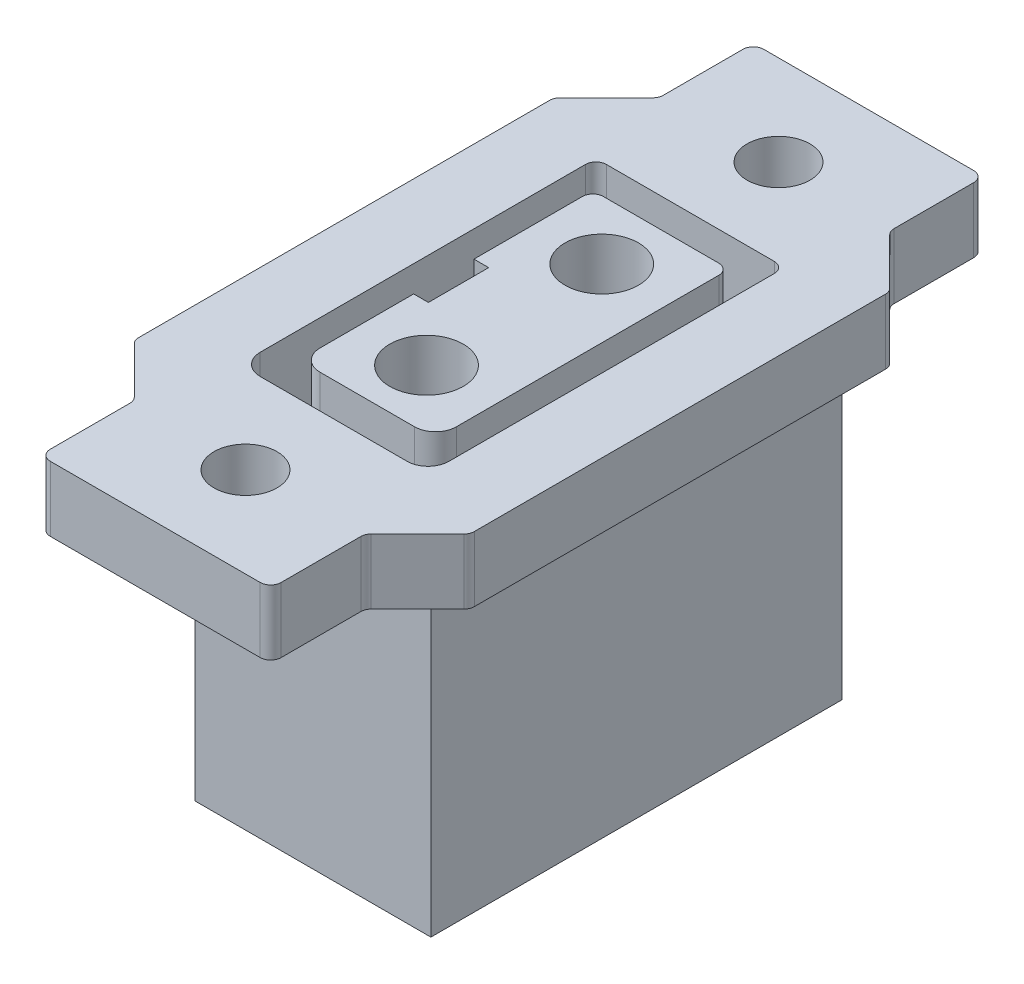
from build123d import *

# Parameters (mm, degrees)
SKETCH1_R             = 1.75
BOSS_EXTRUDE2_DEPTH   = 3.1
SKETCH1_R_2           = 1.5
BOSS_EXTRUDE2_2_DEPTH = 3.1
FILLET1_R             = 0.5
BOSS_EXTRUDE6_START   = 10
SKETCH4_W             = 11.242522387
SKETCH4_H             = 19.58004264
SKETCH4_R             = 1.75
BOSS_EXTRUDE6_DEPTH   = 10
SKETCH5_W             = 11.242522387
SKETCH5_H             = 19.58004264
BOSS_EXTRUDE7_DEPTH   = 5
FILLET2_R             = 0.5


with BuildPart() as part:
    # Sketch1 → Boss-Extrude2 (new body)
    with BuildSketch(Plane(origin=(0, 0, 0), x_dir=(1, 0, 0), z_dir=(0, 1, 0))):
        with BuildLine():
            Line((4.75, 24.104566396), (4.75, 18.436842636))
            Line((4.75, 18.436842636), (5.452424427, 18.436842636))
            Line((5.452424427, 18.436842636), (5.452424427, 15.563157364))
            Line((5.452424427, 15.563157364), (4.75, 15.563157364))
            Line((4.75, 15.563157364), (4.75, 11.102483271))
            ThreePointArc((4.75, 11.102483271), (5.042893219, 10.395376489), (5.75, 10.102483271))
            Line((5.75, 10.102483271), (10.25, 10.102483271))
            ThreePointArc((10.25, 10.102483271), (10.957106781, 10.395376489), (11.25, 11.102483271))
            Line((11.25, 11.102483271), (11.25, 24.104566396))
            Line((11.25, 24.104566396), (4.75, 24.104566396))
        make_face()
        with Locations(Location((8, 21.277803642, 0), (0, 0, 90))):
            Circle(SKETCH1_R, mode=Mode.SUBTRACT)
        with Locations(Location((8, 12.926155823, 0), (0, 0, 90))):
            Circle(SKETCH1_R, mode=Mode.SUBTRACT)
    extrude(amount=BOSS_EXTRUDE2_DEPTH)



with BuildPart() as body_2:
    # Sketch1 → Boss-Extrude2 2 (new body)
    with BuildSketch(Plane(origin=(0, 0, 0), x_dir=(1, 0, 0), z_dir=(0, 1, 0))):
        Polygon((2.5, 29.5), (2.5, 34), (13.5, 34), (13.5, 29.5), (16, 27), (16, 7), (13.5, 4.5), (13.5, 0), (2.5, 0), (2.5, 4.5), (0, 7), (0, 27), align=None)
        with Locations(Location((8, 29.7, 0), (0, 0, 90))):
            Circle(SKETCH1_R_2, mode=Mode.SUBTRACT)
        with Locations(Location((8, 4.3, 0), (0, 0, 90))):
            Circle(SKETCH1_R_2, mode=Mode.SUBTRACT)
        with BuildLine():
            Line((3.5, 25.5), (12.5, 25.5))
            Line((12.5, 25.5), (12.5, 9.5))
            ThreePointArc((12.5, 9.5), (12.207106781, 8.792893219), (11.5, 8.5))
            Line((11.5, 8.5), (4.5, 8.5))
            ThreePointArc((4.5, 8.5), (3.792893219, 8.792893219), (3.5, 9.5))
            Line((3.5, 9.5), (3.5, 25.5))
        make_face(mode=Mode.SUBTRACT)
    extrude(amount=BOSS_EXTRUDE2_2_DEPTH)

    # Fillet1
    fillet1_edges = [body_2.edges().sort_by_distance(p)[0] for p in [
        (13.5, 1.55, -4.5),
        (13.5, 1.55, 0),
        (2.5, 1.55, 0),
        (2.5, 1.55, -4.5),
        (0, 1.55, -7),
        (0, 1.55, -27),
        (2.5, 1.55, -29.5),
        (2.5, 1.55, -34),
        (13.5, 1.55, -34),
        (13.5, 1.55, -29.5),
        (16, 1.55, -27),
        (16, 1.55, -7),
    ]]
    fillet(fillet1_edges, radius=FILLET1_R)


with BuildPart() as part_1:
    add(part.part)

    add(body_2.part)  # Boss-Extrude6 merges body 2
    # Sketch4 → Boss-Extrude6 (add)
    # profile 1 of 2: a face of its own
    with BuildSketch(Plane.XZ.offset(BOSS_EXTRUDE6_START)):
        with Locations((7.983587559, -17.320042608)):
            Rectangle(SKETCH4_W, SKETCH4_H)
        with BuildLine():
            Line((4.5, -8.5), (11.5, -8.5))
            ThreePointArc((11.5, -8.5), (12.207106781, -8.792893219), (12.5, -9.5))
            Line((12.5, -9.5), (12.5, -25.5))
            Line((12.5, -25.5), (3.5, -25.5))
            Line((3.5, -25.5), (3.5, -9.5))
            ThreePointArc((3.5, -9.5), (3.792893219, -8.792893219), (4.5, -8.5))
        make_face(mode=Mode.SUBTRACT)
    # profile 2 of 2: a face of its own
    with BuildSketch(Plane.XZ.offset(BOSS_EXTRUDE6_START)):
        with BuildLine():
            Line((5.75, -10.102483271), (10.25, -10.102483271))
            ThreePointArc((10.25, -10.102483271), (10.957106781, -10.395376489), (11.25, -11.102483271))
            Line((11.25, -11.102483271), (11.25, -24.104566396))
            Line((11.25, -24.104566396), (4.75, -24.104566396))
            Line((4.75, -24.104566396), (4.75, -18.436842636))
            Line((4.75, -18.436842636), (5.452424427, -18.436842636))
            Line((5.452424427, -18.436842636), (5.452424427, -15.563157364))
            Line((5.452424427, -15.563157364), (4.75, -15.563157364))
            Line((4.75, -15.563157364), (4.75, -11.102483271))
            ThreePointArc((4.75, -11.102483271), (5.042893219, -10.395376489), (5.75, -10.102483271))
        make_face()
        with Locations(Location((8, -21.277803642, 0), (0, 0, 270))):
            Circle(SKETCH4_R, mode=Mode.SUBTRACT)
        with Locations(Location((8, -12.926155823, 0), (0, 0, 270))):
            Circle(SKETCH4_R, mode=Mode.SUBTRACT)
    extrude(amount=-BOSS_EXTRUDE6_DEPTH)

    # Sketch5 → Boss-Extrude7 (add)
    with BuildSketch(Plane.XZ.offset(10)):
        with Locations((7.983587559, -17.320042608)):
            Rectangle(SKETCH5_W, SKETCH5_H)
    extrude(amount=BOSS_EXTRUDE7_DEPTH)

    # Fillet2
    fillet2_edges = [part_1.edges().sort_by_distance(p)[0] for p in [
        (11.25, -3.45, -24.104566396),
        (4.75, -3.45, -24.104566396),
        (12.5, -3.45, -25.5),
        (3.5, -3.45, -25.5),
    ]]
    fillet(fillet2_edges, radius=FILLET2_R)


solid = part_1.part
